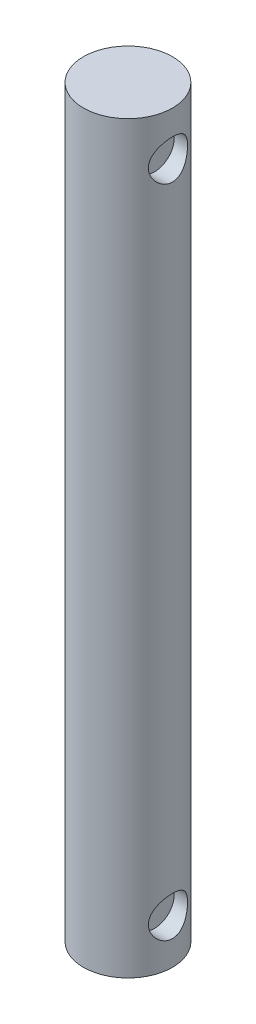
ISO-10303-21;
HEADER;
FILE_DESCRIPTION(('STEP AP214'),'2;1');
FILE_NAME('part.step','',(''),(''),'','','');
FILE_SCHEMA(('AUTOMOTIVE_DESIGN { 1 0 10303 214 1 1 1 1 }'));
ENDSEC;
DATA;
#1=APPLICATION_CONTEXT('core data for automotive mechanical design processes');
#2=APPLICATION_PROTOCOL_DEFINITION('international standard','automotive_design',2000,#1);
#3=PRODUCT_CONTEXT('',#1,'mechanical');
#4=PRODUCT('Part','Part','',(#3));
#5=PRODUCT_RELATED_PRODUCT_CATEGORY('part','',(#4));
#6=PRODUCT_DEFINITION_FORMATION('','',#4);
#7=PRODUCT_DEFINITION_CONTEXT('part definition',#1,'design');
#8=PRODUCT_DEFINITION('design','',#6,#7);
#9=PRODUCT_DEFINITION_SHAPE('','',#8);
#10=(LENGTH_UNIT() NAMED_UNIT(*) SI_UNIT(.MILLI.,.METRE.));
#11=(NAMED_UNIT(*) PLANE_ANGLE_UNIT() SI_UNIT($,.RADIAN.));
#12=(NAMED_UNIT(*) SI_UNIT($,.STERADIAN.) SOLID_ANGLE_UNIT());
#13=UNCERTAINTY_MEASURE_WITH_UNIT(LENGTH_MEASURE(1.E-05),#10,'distance_accuracy_value','');
#14=(GEOMETRIC_REPRESENTATION_CONTEXT(3) GLOBAL_UNCERTAINTY_ASSIGNED_CONTEXT((#13)) GLOBAL_UNIT_ASSIGNED_CONTEXT((#10,
#11,#12)) REPRESENTATION_CONTEXT('',''));
#15=CARTESIAN_POINT('',(0.,0.,0.));
#16=DIRECTION('',(0.,0.,1.));
#17=DIRECTION('',(1.,0.,0.));
#18=AXIS2_PLACEMENT_3D('',#15,#16,#17);
#19=CARTESIAN_POINT('',(0.,41.8,0.));
#20=DIRECTION('',(0.,-1.,0.));
#21=DIRECTION('',(0.,0.,-1.));
#22=AXIS2_PLACEMENT_3D('',#19,#20,#21);
#23=CYLINDRICAL_SURFACE('',#22,2.5);
#24=CARTESIAN_POINT('',(2.24499443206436,39.3,-1.1));
#25=CARTESIAN_POINT('',(2.24500186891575,39.241674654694,-1.09999264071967));
#26=CARTESIAN_POINT('',(2.2473008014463,39.183269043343,-1.09533182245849));
#27=CARTESIAN_POINT('',(2.2561976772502,39.0681643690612,-1.07687935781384));
#28=CARTESIAN_POINT('',(2.26280665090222,39.0114700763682,-1.06306428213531));
#29=CARTESIAN_POINT('',(2.27941479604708,38.9016706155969,-1.02696546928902));
#30=CARTESIAN_POINT('',(2.28939904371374,38.8485508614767,-1.00471896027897));
#31=CARTESIAN_POINT('',(2.31161149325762,38.7468109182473,-0.95249897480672));
#32=CARTESIAN_POINT('',(2.32383934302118,38.6981900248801,-0.922526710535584));
#33=CARTESIAN_POINT('',(2.35011094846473,38.6034189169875,-0.853478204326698));
#34=CARTESIAN_POINT('',(2.36422061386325,38.5576185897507,-0.813946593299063));
#35=CARTESIAN_POINT('',(2.39212743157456,38.4730354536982,-0.72785536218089));
#36=CARTESIAN_POINT('',(2.40592445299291,38.4342555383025,-0.681292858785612));
#37=CARTESIAN_POINT('',(2.43246847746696,38.3629552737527,-0.57964322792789));
#38=CARTESIAN_POINT('',(2.44513005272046,38.330838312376,-0.52424879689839));
#39=CARTESIAN_POINT('',(2.46715746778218,38.2765331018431,-0.408184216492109));
#40=CARTESIAN_POINT('',(2.47652493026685,38.2543399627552,-0.347516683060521));
#41=CARTESIAN_POINT('',(2.49043942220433,38.221810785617,-0.226310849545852));
#42=CARTESIAN_POINT('',(2.49523168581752,38.210868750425,-0.165963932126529));
#43=CARTESIAN_POINT('',(2.5003531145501,38.1991843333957,-0.0441134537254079));
#44=CARTESIAN_POINT('',(2.50068431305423,38.1984373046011,0.0173895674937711));
#45=CARTESIAN_POINT('',(2.49698346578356,38.2068682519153,0.135361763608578));
#46=CARTESIAN_POINT('',(2.49324539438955,38.2153774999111,0.191889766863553));
#47=CARTESIAN_POINT('',(2.48224055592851,38.2409199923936,0.302619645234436));
#48=CARTESIAN_POINT('',(2.47497352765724,38.257953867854,0.356821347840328));
#49=CARTESIAN_POINT('',(2.4574634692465,38.3002491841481,0.462364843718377));
#50=CARTESIAN_POINT('',(2.44717667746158,38.3256323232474,0.513650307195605));
#51=CARTESIAN_POINT('',(2.42461273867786,38.3837772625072,0.611368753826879));
#52=CARTESIAN_POINT('',(2.41233486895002,38.4165417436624,0.657799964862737));
#53=CARTESIAN_POINT('',(2.3858801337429,38.4914553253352,0.748309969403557));
#54=CARTESIAN_POINT('',(2.37162983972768,38.5341340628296,0.791929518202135));
#55=CARTESIAN_POINT('',(2.34352160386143,38.6261947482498,0.871604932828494));
#56=CARTESIAN_POINT('',(2.32966385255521,38.6755798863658,0.907657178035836));
#57=CARTESIAN_POINT('',(2.30334986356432,38.7821330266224,0.97255186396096));
#58=CARTESIAN_POINT('',(2.29097226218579,38.8395339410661,1.00104660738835));
#59=CARTESIAN_POINT('',(2.2699857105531,38.9590063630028,1.0477731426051));
#60=CARTESIAN_POINT('',(2.26137370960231,39.0210740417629,1.06601324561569));
#61=CARTESIAN_POINT('',(2.24967637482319,39.1435036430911,1.09047181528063));
#62=CARTESIAN_POINT('',(2.24624709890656,39.2036820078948,1.09744082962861));
#63=CARTESIAN_POINT('',(2.24431716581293,39.3244332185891,1.10138444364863));
#64=CARTESIAN_POINT('',(2.24581444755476,39.3850058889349,1.09836322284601));
#65=CARTESIAN_POINT('',(2.2532104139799,39.5000255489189,1.08309883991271));
#66=CARTESIAN_POINT('',(2.25877064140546,39.55459128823,1.07156417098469));
#67=CARTESIAN_POINT('',(2.27321525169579,39.6609541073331,1.04056836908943));
#68=CARTESIAN_POINT('',(2.28210047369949,39.7127504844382,1.0211052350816));
#69=CARTESIAN_POINT('',(2.30267121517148,39.814684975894,0.973855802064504));
#70=CARTESIAN_POINT('',(2.31446359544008,39.8646472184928,0.945738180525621));
#71=CARTESIAN_POINT('',(2.33938364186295,39.9594010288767,0.882295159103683));
#72=CARTESIAN_POINT('',(2.35251192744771,40.0041901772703,0.846966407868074));
#73=CARTESIAN_POINT('',(2.38009237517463,40.0916565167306,0.766250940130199));
#74=CARTESIAN_POINT('',(2.39455440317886,40.1337526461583,0.720235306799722));
#75=CARTESIAN_POINT('',(2.42206311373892,40.2097508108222,0.621478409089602));
#76=CARTESIAN_POINT('',(2.43510961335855,40.2436517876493,0.568736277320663));
#77=CARTESIAN_POINT('',(2.45847705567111,40.3024187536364,0.457328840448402));
#78=CARTESIAN_POINT('',(2.46877691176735,40.327215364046,0.398622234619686));
#79=CARTESIAN_POINT('',(2.48532596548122,40.3663785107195,0.277295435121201));
#80=CARTESIAN_POINT('',(2.49157788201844,40.3807520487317,0.214677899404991));
#81=CARTESIAN_POINT('',(2.49898163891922,40.3977072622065,0.0924681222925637));
#82=CARTESIAN_POINT('',(2.50048642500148,40.4011054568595,0.033009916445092));
#83=CARTESIAN_POINT('',(2.49923675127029,40.3982653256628,-0.0856232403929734));
#84=CARTESIAN_POINT('',(2.49648319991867,40.3920290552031,-0.144798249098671));
#85=CARTESIAN_POINT('',(2.48722160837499,40.3706808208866,-0.258552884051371));
#86=CARTESIAN_POINT('',(2.48087956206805,40.3559607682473,-0.313220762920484));
#87=CARTESIAN_POINT('',(2.46517470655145,40.3185157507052,-0.419273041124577));
#88=CARTESIAN_POINT('',(2.45581135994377,40.2957893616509,-0.470656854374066));
#89=CARTESIAN_POINT('',(2.43441956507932,40.2418276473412,-0.57128697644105));
#90=CARTESIAN_POINT('',(2.42228866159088,40.2102501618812,-0.620327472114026));
#91=CARTESIAN_POINT('',(2.39675984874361,40.1399579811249,-0.712628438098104));
#92=CARTESIAN_POINT('',(2.38336141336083,40.1012403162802,-0.755886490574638));
#93=CARTESIAN_POINT('',(2.35549351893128,40.01426463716,-0.838875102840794));
#94=CARTESIAN_POINT('',(2.34102108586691,39.9655013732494,-0.878076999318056));
#95=CARTESIAN_POINT('',(2.31365292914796,39.8616865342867,-0.947850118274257));
#96=CARTESIAN_POINT('',(2.30075817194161,39.8066311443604,-0.97841606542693));
#97=CARTESIAN_POINT('',(2.27815955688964,39.6914153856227,-1.02994457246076));
#98=CARTESIAN_POINT('',(2.26846264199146,39.6312442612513,-1.05088627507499));
#99=CARTESIAN_POINT('',(2.25376370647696,39.5077653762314,-1.08206209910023));
#100=CARTESIAN_POINT('',(2.24874593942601,39.4444688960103,-1.09233214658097));
#101=CARTESIAN_POINT('',(2.24547707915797,39.3538983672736,-1.09901270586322));
#102=CARTESIAN_POINT('',(2.24499099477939,39.3269577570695,-1.10000340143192));
#103=CARTESIAN_POINT('',(2.24499443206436,39.3,-1.1));
#104=B_SPLINE_CURVE_WITH_KNOTS('',3,(#24,#25,#26,#27,#28,#29,#30,#31,#32,#33,#34,#35,#36,#37,
#38,#39,#40,#41,#42,#43,#44,#45,#46,#47,#48,#49,#50,#51,#52,#53,#54,#55,#56,#57,#58,#59,#60,#61,
#62,#63,#64,#65,#66,#67,#68,#69,#70,#71,#72,#73,#74,#75,#76,#77,#78,#79,#80,#81,#82,#83,#84,#85,
#86,#87,#88,#89,#90,#91,#92,#93,#94,#95,#96,#97,#98,#99,#100,#101,#102,#103),.UNSPECIFIED.,.T.,
.F.,(4,2,2,2,2,2,2,2,2,2,2,2,2,2,2,2,2,2,2,2,2,2,2,2,2,2,2,2,2,2,2,2,2,2,2,2,2,2,2,4),(0.,
0.174891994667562,0.350233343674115,0.524809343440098,0.699357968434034,0.884928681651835,
1.07057570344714,1.26538500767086,1.46009821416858,1.64366581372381,1.82714973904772,
1.99820752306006,2.16927797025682,2.34296144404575,2.51670810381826,2.70388470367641,
2.89115065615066,3.08593731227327,3.28056586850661,3.46160310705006,3.64256461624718,
3.80995675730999,3.97739117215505,4.15226330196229,4.32721688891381,4.51839534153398,
4.70959847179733,4.90222980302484,5.09473161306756,5.27253594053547,5.45030234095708,
5.62044885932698,5.79062565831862,5.96859980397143,6.14664813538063,6.33841613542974,
6.53030102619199,6.72259982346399,6.91424912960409,6.99508355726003),.UNSPECIFIED.);
#105=CARTESIAN_POINT('',(2.24499443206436,39.3,-1.1));
#106=VERTEX_POINT('',#105);
#107=EDGE_CURVE('E10',#106,#106,#104,.T.);
#108=ORIENTED_EDGE('',*,*,#107,.T.);
#109=EDGE_LOOP('',(#108));
#110=FACE_BOUND('',#109,.T.);
#111=CARTESIAN_POINT('',(2.24499443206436,2.5,-1.1));
#112=CARTESIAN_POINT('',(2.24500186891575,2.44167465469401,-1.09999264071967));
#113=CARTESIAN_POINT('',(2.2473008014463,2.38326904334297,-1.09533182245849));
#114=CARTESIAN_POINT('',(2.2561976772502,2.2681643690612,-1.07687935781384));
#115=CARTESIAN_POINT('',(2.26280665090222,2.2114700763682,-1.06306428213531));
#116=CARTESIAN_POINT('',(2.27941479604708,2.10167061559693,-1.02696546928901));
#117=CARTESIAN_POINT('',(2.28939904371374,2.04855086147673,-1.00471896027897));
#118=CARTESIAN_POINT('',(2.31161149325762,1.94681091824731,-0.952498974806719));
#119=CARTESIAN_POINT('',(2.32383934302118,1.89819002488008,-0.922526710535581));
#120=CARTESIAN_POINT('',(2.35011094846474,1.80341891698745,-0.853478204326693));
#121=CARTESIAN_POINT('',(2.36422061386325,1.75761858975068,-0.813946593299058));
#122=CARTESIAN_POINT('',(2.39212743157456,1.67303545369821,-0.727855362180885));
#123=CARTESIAN_POINT('',(2.40592445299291,1.63425553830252,-0.681292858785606));
#124=CARTESIAN_POINT('',(2.43246847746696,1.56295527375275,-0.579643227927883));
#125=CARTESIAN_POINT('',(2.44513005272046,1.53083831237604,-0.524248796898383));
#126=CARTESIAN_POINT('',(2.46715746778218,1.47653310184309,-0.408184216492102));
#127=CARTESIAN_POINT('',(2.47652493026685,1.45433996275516,-0.347516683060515));
#128=CARTESIAN_POINT('',(2.49043942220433,1.42181078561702,-0.226310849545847));
#129=CARTESIAN_POINT('',(2.49523168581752,1.41086875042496,-0.165963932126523));
#130=CARTESIAN_POINT('',(2.5003531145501,1.39918433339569,-0.0441134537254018));
#131=CARTESIAN_POINT('',(2.50068431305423,1.39843730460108,0.0173895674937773));
#132=CARTESIAN_POINT('',(2.49698346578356,1.40686825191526,0.135361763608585));
#133=CARTESIAN_POINT('',(2.49324539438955,1.4153774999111,0.19188976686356));
#134=CARTESIAN_POINT('',(2.48224055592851,1.44091999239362,0.302619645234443));
#135=CARTESIAN_POINT('',(2.47497352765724,1.45795386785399,0.356821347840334));
#136=CARTESIAN_POINT('',(2.4574634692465,1.50024918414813,0.462364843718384));
#137=CARTESIAN_POINT('',(2.44717667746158,1.52563232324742,0.513650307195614));
#138=CARTESIAN_POINT('',(2.42461273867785,1.58377726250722,0.611368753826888));
#139=CARTESIAN_POINT('',(2.41233486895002,1.61654174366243,0.657799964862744));
#140=CARTESIAN_POINT('',(2.3858801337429,1.69145532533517,0.748309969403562));
#141=CARTESIAN_POINT('',(2.37162983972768,1.7341340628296,0.791929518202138));
#142=CARTESIAN_POINT('',(2.34352160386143,1.82619474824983,0.871604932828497));
#143=CARTESIAN_POINT('',(2.32966385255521,1.87557988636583,0.907657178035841));
#144=CARTESIAN_POINT('',(2.30334986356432,1.98213302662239,0.972551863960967));
#145=CARTESIAN_POINT('',(2.29097226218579,2.0395339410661,1.00104660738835));
#146=CARTESIAN_POINT('',(2.2699857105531,2.15900636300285,1.0477731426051));
#147=CARTESIAN_POINT('',(2.26137370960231,2.22107404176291,1.06601324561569));
#148=CARTESIAN_POINT('',(2.24967637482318,2.34350364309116,1.09047181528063));
#149=CARTESIAN_POINT('',(2.24624709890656,2.40368200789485,1.09744082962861));
#150=CARTESIAN_POINT('',(2.24431716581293,2.52443321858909,1.10138444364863));
#151=CARTESIAN_POINT('',(2.24581444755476,2.5850058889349,1.09836322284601));
#152=CARTESIAN_POINT('',(2.2532104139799,2.70002554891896,1.08309883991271));
#153=CARTESIAN_POINT('',(2.25877064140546,2.75459128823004,1.07156417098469));
#154=CARTESIAN_POINT('',(2.27321525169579,2.86095410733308,1.04056836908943));
#155=CARTESIAN_POINT('',(2.28210047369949,2.91275048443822,1.02110523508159));
#156=CARTESIAN_POINT('',(2.30267121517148,3.01468497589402,0.973855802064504));
#157=CARTESIAN_POINT('',(2.31446359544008,3.06464721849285,0.945738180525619));
#158=CARTESIAN_POINT('',(2.33938364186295,3.15940102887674,0.88229515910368));
#159=CARTESIAN_POINT('',(2.35251192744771,3.20419017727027,0.846966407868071));
#160=CARTESIAN_POINT('',(2.38009237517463,3.29165651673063,0.766250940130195));
#161=CARTESIAN_POINT('',(2.39455440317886,3.33375264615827,0.720235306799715));
#162=CARTESIAN_POINT('',(2.42206311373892,3.40975081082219,0.621478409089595));
#163=CARTESIAN_POINT('',(2.43510961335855,3.4436517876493,0.568736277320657));
#164=CARTESIAN_POINT('',(2.45847705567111,3.5024187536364,0.457328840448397));
#165=CARTESIAN_POINT('',(2.46877691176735,3.527215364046,0.398622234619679));
#166=CARTESIAN_POINT('',(2.48532596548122,3.56637851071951,0.277295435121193));
#167=CARTESIAN_POINT('',(2.49157788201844,3.58075204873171,0.214677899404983));
#168=CARTESIAN_POINT('',(2.49898163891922,3.59770726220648,0.092468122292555));
#169=CARTESIAN_POINT('',(2.50048642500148,3.60110545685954,0.0330099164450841));
#170=CARTESIAN_POINT('',(2.49923675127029,3.59826532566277,-0.08562324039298));
#171=CARTESIAN_POINT('',(2.49648319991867,3.5920290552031,-0.144798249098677));
#172=CARTESIAN_POINT('',(2.48722160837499,3.57068082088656,-0.258552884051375));
#173=CARTESIAN_POINT('',(2.48087956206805,3.5559607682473,-0.313220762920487));
#174=CARTESIAN_POINT('',(2.46517470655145,3.51851575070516,-0.41927304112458));
#175=CARTESIAN_POINT('',(2.45581135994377,3.49578936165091,-0.47065685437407));
#176=CARTESIAN_POINT('',(2.43441956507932,3.4418276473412,-0.571286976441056));
#177=CARTESIAN_POINT('',(2.42228866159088,3.41025016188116,-0.620327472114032));
#178=CARTESIAN_POINT('',(2.39675984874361,3.33995798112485,-0.712628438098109));
#179=CARTESIAN_POINT('',(2.38336141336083,3.30124031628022,-0.755886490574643));
#180=CARTESIAN_POINT('',(2.35549351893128,3.21426463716,-0.838875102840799));
#181=CARTESIAN_POINT('',(2.34102108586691,3.16550137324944,-0.878076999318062));
#182=CARTESIAN_POINT('',(2.31365292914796,3.06168653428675,-0.947850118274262));
#183=CARTESIAN_POINT('',(2.30075817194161,3.00663114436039,-0.978416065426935));
#184=CARTESIAN_POINT('',(2.27815955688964,2.89141538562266,-1.02994457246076));
#185=CARTESIAN_POINT('',(2.26846264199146,2.83124426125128,-1.05088627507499));
#186=CARTESIAN_POINT('',(2.25376370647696,2.70776537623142,-1.08206209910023));
#187=CARTESIAN_POINT('',(2.24874593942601,2.64446889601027,-1.09233214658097));
#188=CARTESIAN_POINT('',(2.24547707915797,2.55389836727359,-1.09901270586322));
#189=CARTESIAN_POINT('',(2.24499099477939,2.52695775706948,-1.10000340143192));
#190=CARTESIAN_POINT('',(2.24499443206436,2.5,-1.1));
#191=B_SPLINE_CURVE_WITH_KNOTS('',3,(#111,#112,#113,#114,#115,#116,#117,#118,#119,#120,#121,
#122,#123,#124,#125,#126,#127,#128,#129,#130,#131,#132,#133,#134,#135,#136,#137,#138,#139,#140,
#141,#142,#143,#144,#145,#146,#147,#148,#149,#150,#151,#152,#153,#154,#155,#156,#157,#158,#159,
#160,#161,#162,#163,#164,#165,#166,#167,#168,#169,#170,#171,#172,#173,#174,#175,#176,#177,#178,
#179,#180,#181,#182,#183,#184,#185,#186,#187,#188,#189,#190),.UNSPECIFIED.,.T.,.F.,(4,2,2,2,2,2,
2,2,2,2,2,2,2,2,2,2,2,2,2,2,2,2,2,2,2,2,2,2,2,2,2,2,2,2,2,2,2,2,2,4),(0.,0.174891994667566,
0.35023334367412,0.524809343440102,0.699357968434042,0.884928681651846,1.07057570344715,
1.26538500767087,1.46009821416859,1.64366581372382,1.82714973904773,1.99820752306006,
2.16927797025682,2.34296144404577,2.51670810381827,2.70388470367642,2.89115065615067,
3.08593731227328,3.28056586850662,3.46160310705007,3.64256461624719,3.80995675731,
3.97739117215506,4.1522633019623,4.32721688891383,4.51839534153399,4.70959847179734,
4.90222980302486,5.09473161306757,5.27253594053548,5.45030234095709,5.62044885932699,
5.79062565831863,5.96859980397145,6.14664813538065,6.33841613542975,6.530301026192,
6.722599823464,6.91424912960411,6.99508355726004),.UNSPECIFIED.);
#192=CARTESIAN_POINT('',(2.24499443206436,2.5,-1.1));
#193=VERTEX_POINT('',#192);
#194=EDGE_CURVE('E49',#193,#193,#191,.T.);
#195=ORIENTED_EDGE('',*,*,#194,.T.);
#196=EDGE_LOOP('',(#195));
#197=FACE_BOUND('',#196,.T.);
#198=CARTESIAN_POINT('',(0.,41.8,0.));
#199=DIRECTION('',(0.,1.,0.));
#200=DIRECTION('',(0.,0.,1.));
#201=AXIS2_PLACEMENT_3D('',#198,#199,#200);
#202=CIRCLE('',#201,2.5);
#203=CARTESIAN_POINT('',(0.,41.8,2.5));
#204=VERTEX_POINT('',#203);
#205=EDGE_CURVE('E54',#204,#204,#202,.T.);
#206=ORIENTED_EDGE('',*,*,#205,.F.);
#207=EDGE_LOOP('',(#206));
#208=FACE_BOUND('',#207,.T.);
#209=CARTESIAN_POINT('',(0.,0.,0.));
#210=DIRECTION('',(0.,1.,0.));
#211=DIRECTION('',(0.,0.,1.));
#212=AXIS2_PLACEMENT_3D('',#209,#210,#211);
#213=CIRCLE('',#212,2.5);
#214=CARTESIAN_POINT('',(0.,0.,2.5));
#215=VERTEX_POINT('',#214);
#216=EDGE_CURVE('E59',#215,#215,#213,.T.);
#217=ORIENTED_EDGE('',*,*,#216,.T.);
#218=EDGE_LOOP('',(#217));
#219=FACE_BOUND('',#218,.T.);
#220=ADVANCED_FACE('F37',(#110,#197,#208,#219),#23,.T.);
#221=CARTESIAN_POINT('',(0.,41.8,0.));
#222=DIRECTION('',(0.,1.,0.));
#223=DIRECTION('',(0.,0.,1.));
#224=AXIS2_PLACEMENT_3D('',#221,#222,#223);
#225=PLANE('',#224);
#226=ORIENTED_EDGE('',*,*,#205,.T.);
#227=EDGE_LOOP('',(#226));
#228=FACE_BOUND('',#227,.T.);
#229=ADVANCED_FACE('F74',(#228),#225,.T.);
#230=CARTESIAN_POINT('',(0.,0.,0.));
#231=DIRECTION('',(0.,1.,0.));
#232=DIRECTION('',(0.,0.,1.));
#233=AXIS2_PLACEMENT_3D('',#230,#231,#232);
#234=PLANE('',#233);
#235=ORIENTED_EDGE('',*,*,#216,.F.);
#236=EDGE_LOOP('',(#235));
#237=FACE_BOUND('',#236,.T.);
#238=ADVANCED_FACE('F72',(#237),#234,.F.);
#239=CARTESIAN_POINT('',(1.5,2.5,0.));
#240=DIRECTION('',(1.,0.,0.));
#241=DIRECTION('',(0.,0.,-1.));
#242=AXIS2_PLACEMENT_3D('',#239,#240,#241);
#243=CYLINDRICAL_SURFACE('',#242,1.1);
#244=CARTESIAN_POINT('',(1.5,2.5,0.));
#245=DIRECTION('',(1.,0.,0.));
#246=DIRECTION('',(0.,0.,-1.));
#247=AXIS2_PLACEMENT_3D('',#244,#245,#246);
#248=CIRCLE('',#247,1.1);
#249=CARTESIAN_POINT('',(1.5,2.5,-1.1));
#250=VERTEX_POINT('',#249);
#251=EDGE_CURVE('E93',#250,#250,#248,.T.);
#252=ORIENTED_EDGE('',*,*,#251,.F.);
#253=EDGE_LOOP('',(#252));
#254=FACE_BOUND('',#253,.T.);
#255=ORIENTED_EDGE('',*,*,#194,.F.);
#256=EDGE_LOOP('',(#255));
#257=FACE_BOUND('',#256,.T.);
#258=ADVANCED_FACE('F66',(#254,#257),#243,.F.);
#259=CARTESIAN_POINT('',(1.5,2.5,0.));
#260=DIRECTION('',(1.,0.,0.));
#261=DIRECTION('',(0.,0.,-1.));
#262=AXIS2_PLACEMENT_3D('',#259,#260,#261);
#263=PLANE('',#262);
#264=ORIENTED_EDGE('',*,*,#251,.T.);
#265=EDGE_LOOP('',(#264));
#266=FACE_BOUND('',#265,.T.);
#267=ADVANCED_FACE('F71',(#266),#263,.T.);
#268=CARTESIAN_POINT('',(1.5,39.3,0.));
#269=DIRECTION('',(1.,0.,0.));
#270=DIRECTION('',(0.,0.,-1.));
#271=AXIS2_PLACEMENT_3D('',#268,#269,#270);
#272=CYLINDRICAL_SURFACE('',#271,1.1);
#273=CARTESIAN_POINT('',(1.5,39.3,0.));
#274=DIRECTION('',(1.,0.,0.));
#275=DIRECTION('',(0.,0.,-1.));
#276=AXIS2_PLACEMENT_3D('',#273,#274,#275);
#277=CIRCLE('',#276,1.1);
#278=CARTESIAN_POINT('',(1.5,39.3,-1.1));
#279=VERTEX_POINT('',#278);
#280=EDGE_CURVE('E90',#279,#279,#277,.T.);
#281=ORIENTED_EDGE('',*,*,#280,.F.);
#282=EDGE_LOOP('',(#281));
#283=FACE_BOUND('',#282,.T.);
#284=ORIENTED_EDGE('',*,*,#107,.F.);
#285=EDGE_LOOP('',(#284));
#286=FACE_BOUND('',#285,.T.);
#287=ADVANCED_FACE('F104',(#283,#286),#272,.F.);
#288=CARTESIAN_POINT('',(1.5,39.3,0.));
#289=DIRECTION('',(1.,0.,0.));
#290=DIRECTION('',(0.,0.,-1.));
#291=AXIS2_PLACEMENT_3D('',#288,#289,#290);
#292=PLANE('',#291);
#293=ORIENTED_EDGE('',*,*,#280,.T.);
#294=EDGE_LOOP('',(#293));
#295=FACE_BOUND('',#294,.T.);
#296=ADVANCED_FACE('F108',(#295),#292,.T.);
#297=CLOSED_SHELL('',(#220,#229,#238,#258,#267,#287,#296));
#298=MANIFOLD_SOLID_BREP('B2',#297);
#299=ADVANCED_BREP_SHAPE_REPRESENTATION('',(#18,#298),#14);
#300=SHAPE_DEFINITION_REPRESENTATION(#9,#299);
ENDSEC;
END-ISO-10303-21;
